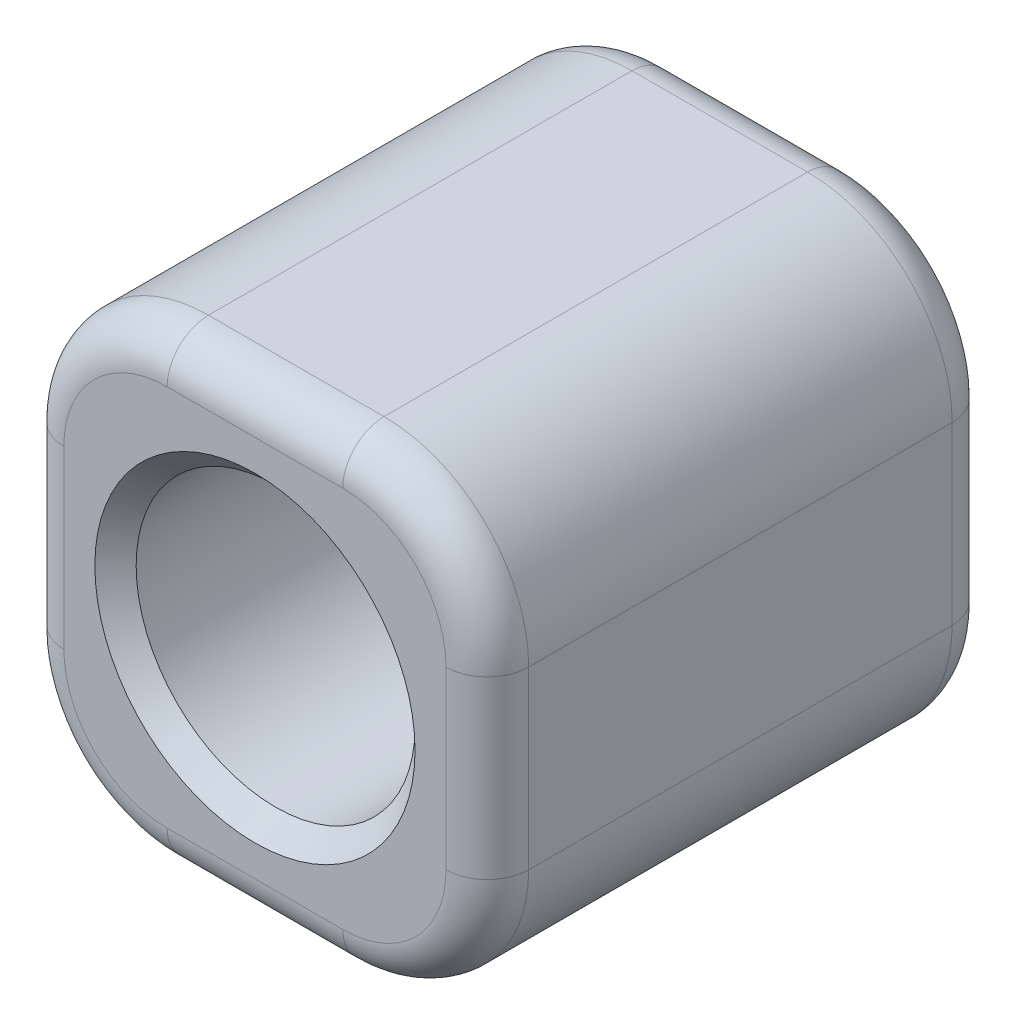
from build123d import *

# Parameters (mm, degrees)
ESQUISSE1_R          = 6.75
BASE_EXTRUSION_DEPTH = 24.5
CONG_1_R             = 2
CHANFREIN1_SIZE      = 1


with BuildPart() as part:
    # Esquisse1 → Base-Extrusion (new body)
    with BuildSketch(Plane.XY):
        with BuildLine():
            Line((-11.25, -4.25), (-11.25, 4.25))
            ThreePointArc((-11.25, 4.25), (-9.199747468, 9.199747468), (-4.25, 11.25))
            Line((-4.25, 11.25), (4.25, 11.25))
            ThreePointArc((4.25, 11.25), (9.199747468, 9.199747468), (11.25, 4.25))
            Line((11.25, 4.25), (11.25, -4.25))
            ThreePointArc((11.25, -4.25), (9.199747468, -9.199747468), (4.25, -11.25))
            Line((4.25, -11.25), (-4.25, -11.25))
            ThreePointArc((-4.25, -11.25), (-9.199747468, -9.199747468), (-11.25, -4.25))
        make_face()
        with Locations(Location((0, 0, 0), (0, 0, 180))):
            Circle(ESQUISSE1_R, mode=Mode.SUBTRACT)
    extrude(amount=BASE_EXTRUSION_DEPTH)

    # Cong_1
    cong_1_edges = [part.edges().sort_by_distance(p)[0] for p in [
        (-11.25, 0, 0),
        (-11.25, 0, 24.5),
        (-9.199747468, 9.199747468, 0),
        (-9.199747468, 9.199747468, 24.5),
        (0, 11.25, 0),
        (0, 11.25, 24.5),
        (9.199747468, 9.199747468, 0),
        (9.199747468, 9.199747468, 24.5),
        (11.25, 0, 0),
        (11.25, 0, 24.5),
        (9.199747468, -9.199747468, 0),
        (9.199747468, -9.199747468, 24.5),
        (0, -11.25, 0),
        (0, -11.25, 24.5),
        (-9.199747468, -9.199747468, 0),
        (-9.199747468, -9.199747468, 24.5),
    ]]
    fillet(cong_1_edges, radius=CONG_1_R)

    # Chanfrein1
    chanfrein1_edges = [part.edges().sort_by_distance(p)[0] for p in [
        (6.75, 0, 0),
        (6.75, 0, 24.5),
    ]]
    chamfer(chanfrein1_edges, length=CHANFREIN1_SIZE)


solid = part.part
